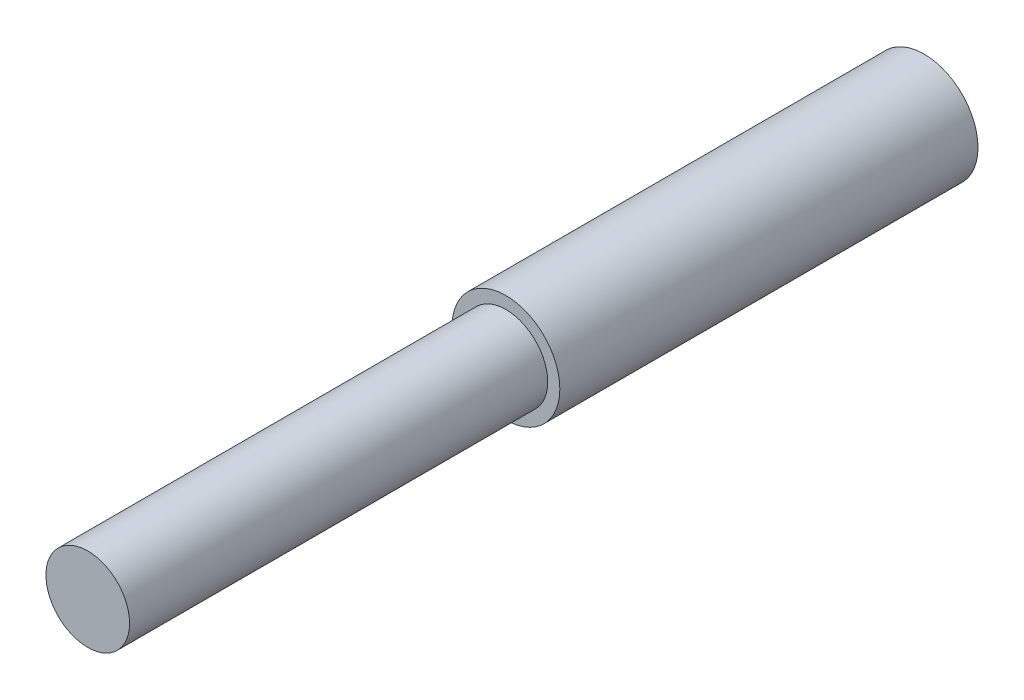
from build123d import *

# Parameters (mm, degrees)
SKETCH1_R           = 6.223
BOSS_EXTRUDE1_DEPTH = 48.26
SKETCH2_R           = 4.826
BOSS_EXTRUDE2_DEPTH = 48.26


with BuildPart() as part:
    # Sketch1 → Boss-Extrude1 (new body)
    with BuildSketch(Plane.XY):
        Circle(SKETCH1_R)
    extrude(amount=BOSS_EXTRUDE1_DEPTH)

    # Sketch2 → Boss-Extrude2 (add)
    with BuildSketch(Plane.XY.offset(48.26)):
        Circle(SKETCH2_R)
    extrude(amount=BOSS_EXTRUDE2_DEPTH)


solid = part.part
